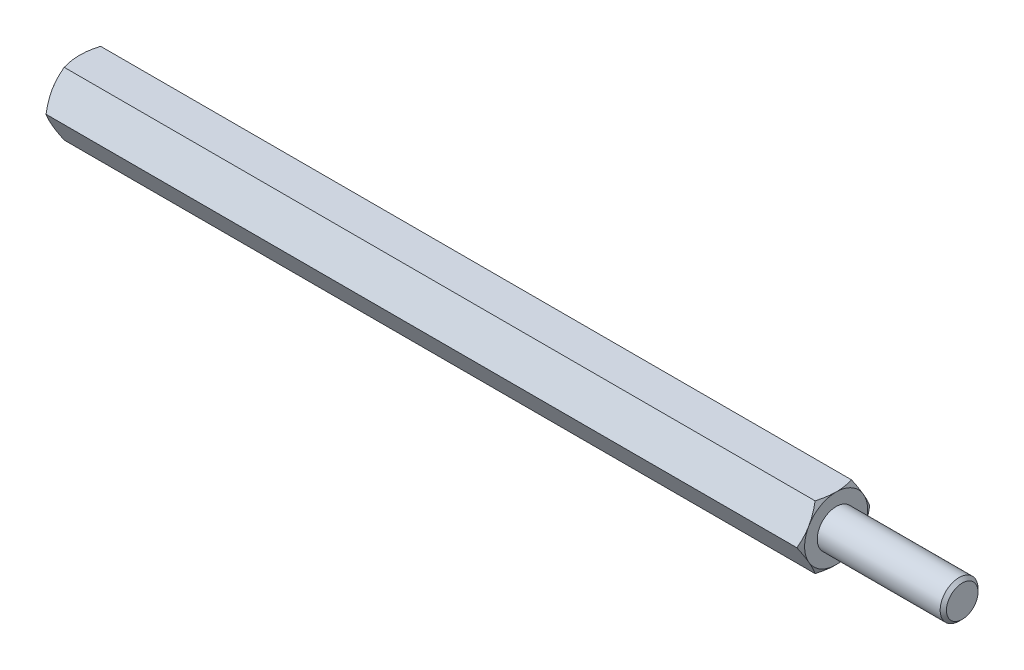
ISO-10303-21;
HEADER;
FILE_DESCRIPTION(('STEP AP214'),'2;1');
FILE_NAME('part.step','',(''),(''),'','','');
FILE_SCHEMA(('AUTOMOTIVE_DESIGN { 1 0 10303 214 1 1 1 1 }'));
ENDSEC;
DATA;
#1=APPLICATION_CONTEXT('core data for automotive mechanical design processes');
#2=APPLICATION_PROTOCOL_DEFINITION('international standard','automotive_design',2000,#1);
#3=PRODUCT_CONTEXT('',#1,'mechanical');
#4=PRODUCT('Part','Part','',(#3));
#5=PRODUCT_RELATED_PRODUCT_CATEGORY('part','',(#4));
#6=PRODUCT_DEFINITION_FORMATION('','',#4);
#7=PRODUCT_DEFINITION_CONTEXT('part definition',#1,'design');
#8=PRODUCT_DEFINITION('design','',#6,#7);
#9=PRODUCT_DEFINITION_SHAPE('','',#8);
#10=(LENGTH_UNIT() NAMED_UNIT(*) SI_UNIT(.MILLI.,.METRE.));
#11=(NAMED_UNIT(*) PLANE_ANGLE_UNIT() SI_UNIT($,.RADIAN.));
#12=(NAMED_UNIT(*) SI_UNIT($,.STERADIAN.) SOLID_ANGLE_UNIT());
#13=UNCERTAINTY_MEASURE_WITH_UNIT(LENGTH_MEASURE(1.E-05),#10,'distance_accuracy_value','');
#14=(GEOMETRIC_REPRESENTATION_CONTEXT(3) GLOBAL_UNCERTAINTY_ASSIGNED_CONTEXT((#13)) GLOBAL_UNIT_ASSIGNED_CONTEXT((#10,
#11,#12)) REPRESENTATION_CONTEXT('',''));
#15=CARTESIAN_POINT('',(0.,0.,0.));
#16=DIRECTION('',(0.,0.,1.));
#17=DIRECTION('',(1.,0.,0.));
#18=AXIS2_PLACEMENT_3D('',#15,#16,#17);
#19=CARTESIAN_POINT('',(30.,2.5,-1.44337567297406));
#20=DIRECTION('',(1.,0.,0.));
#21=DIRECTION('',(0.,0.,-1.));
#22=AXIS2_PLACEMENT_3D('',#19,#20,#21);
#23=PLANE('',#22);
#24=CARTESIAN_POINT('',(30.,0.,0.));
#25=DIRECTION('',(1.,0.,0.));
#26=DIRECTION('',(0.,0.,-1.));
#27=AXIS2_PLACEMENT_3D('',#24,#25,#26);
#28=CIRCLE('',#27,2.50000000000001);
#29=CARTESIAN_POINT('',(30.,-1.25,-2.16506350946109));
#30=VERTEX_POINT('',#29);
#31=CARTESIAN_POINT('',(30.,1.25,-2.1650635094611));
#32=VERTEX_POINT('',#31);
#33=EDGE_CURVE('E288',#30,#32,#28,.T.);
#34=ORIENTED_EDGE('',*,*,#33,.T.);
#35=CARTESIAN_POINT('',(30.,2.5,0.));
#36=VERTEX_POINT('',#35);
#37=EDGE_CURVE('E53',#32,#36,#28,.T.);
#38=ORIENTED_EDGE('',*,*,#37,.T.);
#39=CARTESIAN_POINT('',(30.,1.25,2.1650635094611));
#40=VERTEX_POINT('',#39);
#41=EDGE_CURVE('E296',#36,#40,#28,.T.);
#42=ORIENTED_EDGE('',*,*,#41,.T.);
#43=CARTESIAN_POINT('',(30.,-1.25000000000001,2.1650635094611));
#44=VERTEX_POINT('',#43);
#45=EDGE_CURVE('E300',#40,#44,#28,.T.);
#46=ORIENTED_EDGE('',*,*,#45,.T.);
#47=CARTESIAN_POINT('',(30.,0.,0.));
#48=DIRECTION('',(-1.,0.,0.));
#49=DIRECTION('',(0.,-1.,0.));
#50=AXIS2_PLACEMENT_3D('',#47,#48,#49);
#51=CIRCLE('',#50,2.50000000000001);
#52=CARTESIAN_POINT('',(30.,-2.50000000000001,0.));
#53=VERTEX_POINT('',#52);
#54=EDGE_CURVE('E193',#53,#44,#51,.T.);
#55=ORIENTED_EDGE('',*,*,#54,.F.);
#56=EDGE_CURVE('E61',#53,#30,#28,.T.);
#57=ORIENTED_EDGE('',*,*,#56,.T.);
#58=EDGE_LOOP('',(#34,#38,#42,#46,#55,#57));
#59=FACE_BOUND('',#58,.T.);
#60=CARTESIAN_POINT('',(30.,0.,0.));
#61=DIRECTION('',(1.,0.,0.));
#62=DIRECTION('',(0.,0.,-1.));
#63=AXIS2_PLACEMENT_3D('',#60,#61,#62);
#64=CIRCLE('',#63,1.5);
#65=CARTESIAN_POINT('',(30.,0.,-1.5));
#66=VERTEX_POINT('',#65);
#67=EDGE_CURVE('E311',#66,#66,#64,.T.);
#68=ORIENTED_EDGE('',*,*,#67,.F.);
#69=EDGE_LOOP('',(#68));
#70=FACE_BOUND('',#69,.T.);
#71=ADVANCED_FACE('F37',(#59,#70),#23,.T.);
#72=CARTESIAN_POINT('',(30.,0.,-2.88675134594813));
#73=DIRECTION('',(0.,-0.5,0.866025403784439));
#74=DIRECTION('',(0.,-0.866025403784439,-0.5));
#75=AXIS2_PLACEMENT_3D('',#72,#73,#74);
#76=PLANE('',#75);
#77=CARTESIAN_POINT('',(29.7766423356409,-0.000200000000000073,-2.88686681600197));
#78=CARTESIAN_POINT('',(29.8132783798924,0.109663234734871,-2.82343724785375));
#79=CARTESIAN_POINT('',(29.8465977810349,0.220474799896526,-2.75946016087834));
#80=CARTESIAN_POINT('',(29.9047577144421,0.44401683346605,-2.63039810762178));
#81=CARTESIAN_POINT('',(29.9295776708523,0.556751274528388,-2.5653108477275));
#82=CARTESIAN_POINT('',(29.9682143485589,0.780822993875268,-2.43594298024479));
#83=CARTESIAN_POINT('',(29.9822882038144,0.892125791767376,-2.37168227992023));
#84=CARTESIAN_POINT('',(29.9990908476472,1.11525522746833,-2.24285844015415));
#85=CARTESIAN_POINT('',(30.0018335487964,1.22708105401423,-2.17829576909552));
#86=CARTESIAN_POINT('',(29.9961342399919,1.43604197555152,-2.05765212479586));
#87=CARTESIAN_POINT('',(29.9890916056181,1.53320831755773,-2.0015531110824));
#88=CARTESIAN_POINT('',(29.9667685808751,1.726907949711,-1.88972057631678));
#89=CARTESIAN_POINT('',(29.9514805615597,1.82344056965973,-1.8339874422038));
#90=CARTESIAN_POINT('',(29.9132609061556,2.01753972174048,-1.7219242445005));
#91=CARTESIAN_POINT('',(29.8901672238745,2.11508168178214,-1.66560836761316));
#92=CARTESIAN_POINT('',(29.8377533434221,2.30871060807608,-1.55381665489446));
#93=CARTESIAN_POINT('',(29.8084454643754,2.40480005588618,-1.49833938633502));
#94=CARTESIAN_POINT('',(29.7766423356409,2.5002,-1.44326020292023));
#95=B_SPLINE_CURVE_WITH_KNOTS('',3,(#77,#78,#79,#80,#81,#82,#83,#84,#85,#86,#87,#88,#89,#90,#91,
#92,#93,#94),.UNSPECIFIED.,.F.,.F.,(4,2,2,2,2,2,2,2,4),(0.,0.396285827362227,0.79352433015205,
1.18093086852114,1.56786160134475,1.90479741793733,2.24204551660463,2.58677531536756,
2.93082800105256),.UNSPECIFIED.);
#96=CARTESIAN_POINT('',(29.7767090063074,0.,-2.88675134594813));
#97=VERTEX_POINT('',#96);
#98=EDGE_CURVE('E316',#97,#32,#95,.T.);
#99=ORIENTED_EDGE('',*,*,#98,.F.);
#100=DIRECTION('',(-1.,0.,0.));
#101=VECTOR('',#100,1.);
#102=CARTESIAN_POINT('',(30.,0.,-2.88675134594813));
#103=LINE('',#102,#101);
#104=CARTESIAN_POINT('',(-29.7767090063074,0.,-2.88675134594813));
#105=VERTEX_POINT('',#104);
#106=EDGE_CURVE('E264',#97,#105,#103,.T.);
#107=ORIENTED_EDGE('',*,*,#106,.T.);
#108=CARTESIAN_POINT('',(-29.7766423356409,2.5002,-1.44326020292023));
#109=CARTESIAN_POINT('',(-29.8132783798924,2.39033676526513,-1.50668977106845));
#110=CARTESIAN_POINT('',(-29.8465977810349,2.27952520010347,-1.57066685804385));
#111=CARTESIAN_POINT('',(-29.9047577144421,2.05598316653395,-1.69972891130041));
#112=CARTESIAN_POINT('',(-29.9295776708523,1.94324872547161,-1.7648161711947));
#113=CARTESIAN_POINT('',(-29.9682143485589,1.71917700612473,-1.8941840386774));
#114=CARTESIAN_POINT('',(-29.9822882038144,1.60787420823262,-1.95844473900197));
#115=CARTESIAN_POINT('',(-29.9990908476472,1.38474477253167,-2.08726857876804));
#116=CARTESIAN_POINT('',(-30.0018335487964,1.27291894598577,-2.15183124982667));
#117=CARTESIAN_POINT('',(-29.9961342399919,1.06395802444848,-2.27247489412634));
#118=CARTESIAN_POINT('',(-29.9890916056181,0.966791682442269,-2.32857390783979));
#119=CARTESIAN_POINT('',(-29.9667685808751,0.773092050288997,-2.44040644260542));
#120=CARTESIAN_POINT('',(-29.9514805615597,0.676559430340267,-2.4961395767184));
#121=CARTESIAN_POINT('',(-29.9132609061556,0.482460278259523,-2.60820277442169));
#122=CARTESIAN_POINT('',(-29.8901672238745,0.384918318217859,-2.66451865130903));
#123=CARTESIAN_POINT('',(-29.8377533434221,0.191289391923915,-2.77631036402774));
#124=CARTESIAN_POINT('',(-29.8084454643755,0.0951999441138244,-2.83178763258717));
#125=CARTESIAN_POINT('',(-29.7766423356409,-0.000200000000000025,-2.88686681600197));
#126=B_SPLINE_CURVE_WITH_KNOTS('',3,(#108,#109,#110,#111,#112,#113,#114,#115,#116,#117,#118,
#119,#120,#121,#122,#123,#124,#125),.UNSPECIFIED.,.F.,.F.,(4,2,2,2,2,2,2,2,4),(0.,
0.396285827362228,0.793524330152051,1.18093086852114,1.56786160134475,1.90479741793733,
2.24204551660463,2.58677531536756,2.93082800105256),.UNSPECIFIED.);
#127=CARTESIAN_POINT('',(-30.,1.25,-2.1650635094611));
#128=VERTEX_POINT('',#127);
#129=EDGE_CURVE('E362',#128,#105,#126,.T.);
#130=ORIENTED_EDGE('',*,*,#129,.F.);
#131=CARTESIAN_POINT('',(-29.7767090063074,2.5,-1.44337567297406));
#132=VERTEX_POINT('',#131);
#133=EDGE_CURVE('E357',#132,#128,#126,.T.);
#134=ORIENTED_EDGE('',*,*,#133,.F.);
#135=DIRECTION('',(-1.,0.,0.));
#136=VECTOR('',#135,1.);
#137=CARTESIAN_POINT('',(30.,2.5,-1.44337567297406));
#138=LINE('',#137,#136);
#139=CARTESIAN_POINT('',(29.7767090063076,2.5,-1.44337567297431));
#140=VERTEX_POINT('',#139);
#141=EDGE_CURVE('E279',#140,#132,#138,.T.);
#142=ORIENTED_EDGE('',*,*,#141,.F.);
#143=EDGE_CURVE('E229',#32,#140,#95,.T.);
#144=ORIENTED_EDGE('',*,*,#143,.F.);
#145=EDGE_LOOP('',(#99,#107,#130,#134,#142,#144));
#146=FACE_BOUND('',#145,.T.);
#147=ADVANCED_FACE('F148',(#146),#76,.F.);
#148=CARTESIAN_POINT('',(30.,2.5,-1.44337567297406));
#149=DIRECTION('',(0.,-1.,0.));
#150=DIRECTION('',(0.,0.,-1.));
#151=AXIS2_PLACEMENT_3D('',#148,#149,#150);
#152=PLANE('',#151);
#153=CARTESIAN_POINT('',(28.7680338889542,2.5,-3.90158441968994));
#154=CARTESIAN_POINT('',(28.8212077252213,2.5,-3.79217004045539));
#155=CARTESIAN_POINT('',(28.8738786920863,2.5,-3.68250707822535));
#156=CARTESIAN_POINT('',(28.9779324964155,2.5,-3.46255185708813));
#157=CARTESIAN_POINT('',(29.0293151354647,2.5,-3.35225950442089));
#158=CARTESIAN_POINT('',(29.1307630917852,2.5,-3.13035696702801));
#159=CARTESIAN_POINT('',(29.1808199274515,2.5,-3.0187428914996));
#160=CARTESIAN_POINT('',(29.2789171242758,2.5,-2.79463535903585));
#161=CARTESIAN_POINT('',(29.3269575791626,2.5,-2.68214194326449));
#162=CARTESIAN_POINT('',(29.4220184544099,2.5,-2.45240385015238));
#163=CARTESIAN_POINT('',(29.4689543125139,2.5,-2.33512399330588));
#164=CARTESIAN_POINT('',(29.5593326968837,2.5,-2.09920133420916));
#165=CARTESIAN_POINT('',(29.6027748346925,2.5,-1.98055838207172));
#166=CARTESIAN_POINT('',(29.6850435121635,2.5,-1.74193489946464));
#167=CARTESIAN_POINT('',(29.7238791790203,2.5,-1.6219575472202));
#168=CARTESIAN_POINT('',(29.7957050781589,2.5,-1.38028205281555));
#169=CARTESIAN_POINT('',(29.8286971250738,2.5,-1.25858445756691));
#170=CARTESIAN_POINT('',(29.8870959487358,2.5,-1.01406369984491));
#171=CARTESIAN_POINT('',(29.9125437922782,2.5,-0.891250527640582));
#172=CARTESIAN_POINT('',(29.9544275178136,2.5,-0.644071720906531));
#173=CARTESIAN_POINT('',(29.9708643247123,2.5,-0.519706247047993));
#174=CARTESIAN_POINT('',(29.9932006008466,2.5,-0.271679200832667));
#175=CARTESIAN_POINT('',(29.9992375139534,2.5,-0.148030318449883));
#176=CARTESIAN_POINT('',(30.0006256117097,2.5,0.0993395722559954));
#177=CARTESIAN_POINT('',(29.9959765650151,2.5,0.223060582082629));
#178=CARTESIAN_POINT('',(29.9794044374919,2.5,0.432351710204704));
#179=CARTESIAN_POINT('',(29.9701066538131,2.5,0.518143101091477));
#180=CARTESIAN_POINT('',(29.9469384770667,2.5,0.68911205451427));
#181=CARTESIAN_POINT('',(29.9330674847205,2.5,0.774289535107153));
#182=CARTESIAN_POINT('',(29.8853202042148,2.5,1.02876599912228));
#183=CARTESIAN_POINT('',(29.8453176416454,2.5,1.19691958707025));
#184=CARTESIAN_POINT('',(29.7522656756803,2.5,1.53362893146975));
#185=CARTESIAN_POINT('',(29.6989362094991,2.5,1.70210423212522));
#186=CARTESIAN_POINT('',(29.6123716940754,2.5,1.95247339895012));
#187=CARTESIAN_POINT('',(29.5824247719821,2.5,2.0355318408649));
#188=CARTESIAN_POINT('',(29.5206840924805,2.5,2.20095860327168));
#189=CARTESIAN_POINT('',(29.4888903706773,2.5,2.28332693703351));
#190=CARTESIAN_POINT('',(29.404014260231,2.5,2.49723312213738));
#191=CARTESIAN_POINT('',(29.3497173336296,2.5,2.62828796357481));
#192=CARTESIAN_POINT('',(29.2381273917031,2.5,2.88912034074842));
#193=CARTESIAN_POINT('',(29.1808341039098,2.5,3.01889775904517));
#194=CARTESIAN_POINT('',(29.0639348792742,2.5,3.27745045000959));
#195=CARTESIAN_POINT('',(29.004328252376,2.5,3.40622540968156));
#196=CARTESIAN_POINT('',(28.8833234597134,2.5,3.66293235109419));
#197=CARTESIAN_POINT('',(28.821925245,2.5,3.7908643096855));
#198=CARTESIAN_POINT('',(28.6354580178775,2.5,4.17399495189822));
#199=CARTESIAN_POINT('',(28.5082824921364,2.5,4.42816724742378));
#200=CARTESIAN_POINT('',(28.2503455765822,2.5,4.93461464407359));
#201=CARTESIAN_POINT('',(28.1195848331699,2.5,5.1868900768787));
#202=CARTESIAN_POINT('',(27.8687100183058,2.5,5.66512451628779));
#203=CARTESIAN_POINT('',(27.7488298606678,2.5,5.89120644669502));
#204=CARTESIAN_POINT('',(27.5075902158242,2.5,6.34259369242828));
#205=CARTESIAN_POINT('',(27.3862306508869,2.5,6.56789896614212));
#206=CARTESIAN_POINT('',(27.142780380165,2.5,7.01722044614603));
#207=CARTESIAN_POINT('',(27.0206930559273,2.5,7.24123848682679));
#208=CARTESIAN_POINT('',(26.7756662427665,2.5,7.68878772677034));
#209=CARTESIAN_POINT('',(26.652726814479,2.5,7.91231895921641));
#210=CARTESIAN_POINT('',(26.5294756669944,2.5,8.1356769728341));
#211=B_SPLINE_CURVE_WITH_KNOTS('',3,(#153,#154,#155,#156,#157,#158,#159,#160,#161,#162,#163,
#164,#165,#166,#167,#168,#169,#170,#171,#172,#173,#174,#175,#176,#177,#178,#179,#180,#181,#182,
#183,#184,#185,#186,#187,#188,#189,#190,#191,#192,#193,#194,#195,#196,#197,#198,#199,#200,#201,
#202,#203,#204,#205,#206,#207,#208,#209,#210),.UNSPECIFIED.,.F.,.F.,(4,2,2,2,2,2,2,2,2,2,2,2,2,
2,2,2,2,2,2,2,2,2,2,2,2,2,2,2,4),(0.,0.364957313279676,0.729970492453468,1.09692930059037,
1.46387103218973,1.84279746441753,2.22176597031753,2.59997058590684,2.97805755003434,
3.3540469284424,3.72999770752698,4.10094071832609,4.47189175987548,4.73064905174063,
4.98944026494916,5.50729076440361,6.037104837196,6.30196454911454,6.56681915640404,
6.99233818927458,7.41789598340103,7.84358170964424,8.26927907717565,9.12186602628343,
9.97430025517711,10.7419897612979,11.509719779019,12.2750964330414,13.0404191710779),.UNSPECIFIED.);
#212=EDGE_CURVE('E227',#140,#36,#211,.T.);
#213=ORIENTED_EDGE('',*,*,#212,.F.);
#214=ORIENTED_EDGE('',*,*,#141,.T.);
#215=CARTESIAN_POINT('',(-28.7680338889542,2.5,-3.90158441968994));
#216=CARTESIAN_POINT('',(-28.8212077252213,2.5,-3.79217004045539));
#217=CARTESIAN_POINT('',(-28.8738786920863,2.5,-3.68250707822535));
#218=CARTESIAN_POINT('',(-28.9779324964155,2.5,-3.46255185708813));
#219=CARTESIAN_POINT('',(-29.0293151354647,2.5,-3.35225950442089));
#220=CARTESIAN_POINT('',(-29.1307630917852,2.5,-3.13035696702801));
#221=CARTESIAN_POINT('',(-29.1808199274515,2.5,-3.0187428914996));
#222=CARTESIAN_POINT('',(-29.2789171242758,2.5,-2.79463535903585));
#223=CARTESIAN_POINT('',(-29.3269575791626,2.5,-2.68214194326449));
#224=CARTESIAN_POINT('',(-29.4220184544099,2.5,-2.45240385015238));
#225=CARTESIAN_POINT('',(-29.4689543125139,2.5,-2.33512399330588));
#226=CARTESIAN_POINT('',(-29.5593326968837,2.5,-2.09920133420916));
#227=CARTESIAN_POINT('',(-29.6027748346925,2.5,-1.98055838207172));
#228=CARTESIAN_POINT('',(-29.6850435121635,2.5,-1.74193489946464));
#229=CARTESIAN_POINT('',(-29.7238791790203,2.5,-1.6219575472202));
#230=CARTESIAN_POINT('',(-29.7957050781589,2.5,-1.38028205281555));
#231=CARTESIAN_POINT('',(-29.8286971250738,2.5,-1.25858445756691));
#232=CARTESIAN_POINT('',(-29.8870959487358,2.5,-1.01406369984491));
#233=CARTESIAN_POINT('',(-29.9125437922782,2.5,-0.891250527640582));
#234=CARTESIAN_POINT('',(-29.9544275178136,2.5,-0.644071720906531));
#235=CARTESIAN_POINT('',(-29.9708643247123,2.5,-0.519706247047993));
#236=CARTESIAN_POINT('',(-29.9932006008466,2.5,-0.271679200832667));
#237=CARTESIAN_POINT('',(-29.9992375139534,2.5,-0.148030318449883));
#238=CARTESIAN_POINT('',(-30.0006256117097,2.5,0.0993395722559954));
#239=CARTESIAN_POINT('',(-29.9959765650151,2.5,0.223060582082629));
#240=CARTESIAN_POINT('',(-29.9794044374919,2.5,0.432351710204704));
#241=CARTESIAN_POINT('',(-29.9701066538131,2.5,0.518143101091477));
#242=CARTESIAN_POINT('',(-29.9469384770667,2.5,0.68911205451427));
#243=CARTESIAN_POINT('',(-29.9330674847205,2.5,0.774289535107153));
#244=CARTESIAN_POINT('',(-29.8853202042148,2.5,1.02876599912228));
#245=CARTESIAN_POINT('',(-29.8453176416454,2.5,1.19691958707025));
#246=CARTESIAN_POINT('',(-29.7522656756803,2.5,1.53362893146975));
#247=CARTESIAN_POINT('',(-29.6989362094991,2.5,1.70210423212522));
#248=CARTESIAN_POINT('',(-29.6123716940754,2.5,1.95247339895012));
#249=CARTESIAN_POINT('',(-29.5824247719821,2.5,2.0355318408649));
#250=CARTESIAN_POINT('',(-29.5206840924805,2.5,2.20095860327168));
#251=CARTESIAN_POINT('',(-29.4888903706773,2.5,2.28332693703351));
#252=CARTESIAN_POINT('',(-29.404014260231,2.5,2.49723312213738));
#253=CARTESIAN_POINT('',(-29.3497173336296,2.5,2.62828796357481));
#254=CARTESIAN_POINT('',(-29.2381273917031,2.5,2.88912034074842));
#255=CARTESIAN_POINT('',(-29.1808341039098,2.5,3.01889775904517));
#256=CARTESIAN_POINT('',(-29.0639348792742,2.5,3.27745045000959));
#257=CARTESIAN_POINT('',(-29.004328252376,2.5,3.40622540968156));
#258=CARTESIAN_POINT('',(-28.8833234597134,2.5,3.66293235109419));
#259=CARTESIAN_POINT('',(-28.821925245,2.5,3.7908643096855));
#260=CARTESIAN_POINT('',(-28.6354580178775,2.5,4.17399495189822));
#261=CARTESIAN_POINT('',(-28.5082824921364,2.5,4.42816724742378));
#262=CARTESIAN_POINT('',(-28.2503455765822,2.5,4.93461464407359));
#263=CARTESIAN_POINT('',(-28.1195848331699,2.5,5.1868900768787));
#264=CARTESIAN_POINT('',(-27.8687100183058,2.5,5.66512451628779));
#265=CARTESIAN_POINT('',(-27.7488298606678,2.5,5.89120644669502));
#266=CARTESIAN_POINT('',(-27.5075902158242,2.5,6.34259369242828));
#267=CARTESIAN_POINT('',(-27.3862306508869,2.5,6.56789896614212));
#268=CARTESIAN_POINT('',(-27.142780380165,2.5,7.01722044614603));
#269=CARTESIAN_POINT('',(-27.0206930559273,2.5,7.24123848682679));
#270=CARTESIAN_POINT('',(-26.7756662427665,2.5,7.68878772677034));
#271=CARTESIAN_POINT('',(-26.652726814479,2.5,7.91231895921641));
#272=CARTESIAN_POINT('',(-26.5294756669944,2.5,8.1356769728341));
#273=B_SPLINE_CURVE_WITH_KNOTS('',3,(#215,#216,#217,#218,#219,#220,#221,#222,#223,#224,#225,
#226,#227,#228,#229,#230,#231,#232,#233,#234,#235,#236,#237,#238,#239,#240,#241,#242,#243,#244,
#245,#246,#247,#248,#249,#250,#251,#252,#253,#254,#255,#256,#257,#258,#259,#260,#261,#262,#263,
#264,#265,#266,#267,#268,#269,#270,#271,#272),.UNSPECIFIED.,.F.,.F.,(4,2,2,2,2,2,2,2,2,2,2,2,2,
2,2,2,2,2,2,2,2,2,2,2,2,2,2,2,4),(0.,0.364957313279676,0.729970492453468,1.09692930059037,
1.46387103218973,1.84279746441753,2.22176597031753,2.59997058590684,2.97805755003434,
3.3540469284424,3.72999770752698,4.10094071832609,4.47189175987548,4.73064905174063,
4.98944026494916,5.50729076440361,6.037104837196,6.30196454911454,6.56681915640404,
6.99233818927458,7.41789598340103,7.84358170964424,8.26927907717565,9.12186602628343,
9.97430025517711,10.7419897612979,11.509719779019,12.2750964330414,13.0404191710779),.UNSPECIFIED.);
#274=CARTESIAN_POINT('',(-30.,2.5,0.));
#275=VERTEX_POINT('',#274);
#276=EDGE_CURVE('E241',#275,#132,#273,.F.);
#277=ORIENTED_EDGE('',*,*,#276,.F.);
#278=CARTESIAN_POINT('',(-29.7767090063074,2.5,1.44337567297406));
#279=VERTEX_POINT('',#278);
#280=EDGE_CURVE('E249',#279,#275,#273,.F.);
#281=ORIENTED_EDGE('',*,*,#280,.F.);
#282=DIRECTION('',(-1.,0.,0.));
#283=VECTOR('',#282,1.);
#284=CARTESIAN_POINT('',(30.,2.5,1.44337567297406));
#285=LINE('',#284,#283);
#286=CARTESIAN_POINT('',(29.7767090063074,2.5,1.44337567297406));
#287=VERTEX_POINT('',#286);
#288=EDGE_CURVE('E276',#287,#279,#285,.T.);
#289=ORIENTED_EDGE('',*,*,#288,.F.);
#290=EDGE_CURVE('E221',#36,#287,#211,.T.);
#291=ORIENTED_EDGE('',*,*,#290,.F.);
#292=EDGE_LOOP('',(#213,#214,#277,#281,#289,#291));
#293=FACE_BOUND('',#292,.T.);
#294=ADVANCED_FACE('F153',(#293),#152,.F.);
#295=CARTESIAN_POINT('',(30.,2.5,1.44337567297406));
#296=DIRECTION('',(0.,-0.5,-0.866025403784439));
#297=DIRECTION('',(0.,0.866025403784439,-0.5));
#298=AXIS2_PLACEMENT_3D('',#295,#296,#297);
#299=PLANE('',#298);
#300=CARTESIAN_POINT('',(29.7766423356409,2.5002,1.44326020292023));
#301=CARTESIAN_POINT('',(29.8132783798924,2.39033676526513,1.50668977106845));
#302=CARTESIAN_POINT('',(29.8465977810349,2.27952520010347,1.57066685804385));
#303=CARTESIAN_POINT('',(29.9047577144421,2.05598316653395,1.69972891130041));
#304=CARTESIAN_POINT('',(29.9295776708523,1.94324872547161,1.7648161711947));
#305=CARTESIAN_POINT('',(29.9682143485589,1.71917700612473,1.8941840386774));
#306=CARTESIAN_POINT('',(29.9822882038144,1.60787420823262,1.95844473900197));
#307=CARTESIAN_POINT('',(29.9990908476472,1.38474477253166,2.08726857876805));
#308=CARTESIAN_POINT('',(30.0018335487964,1.27291894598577,2.15183124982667));
#309=CARTESIAN_POINT('',(29.9961342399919,1.06395802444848,2.27247489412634));
#310=CARTESIAN_POINT('',(29.9890916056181,0.966791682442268,2.32857390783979));
#311=CARTESIAN_POINT('',(29.9667685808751,0.773092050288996,2.44040644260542));
#312=CARTESIAN_POINT('',(29.9514805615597,0.676559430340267,2.4961395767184));
#313=CARTESIAN_POINT('',(29.9132609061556,0.482460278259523,2.60820277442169));
#314=CARTESIAN_POINT('',(29.8901672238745,0.384918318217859,2.66451865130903));
#315=CARTESIAN_POINT('',(29.8377533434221,0.191289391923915,2.77631036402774));
#316=CARTESIAN_POINT('',(29.8084454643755,0.095199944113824,2.83178763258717));
#317=CARTESIAN_POINT('',(29.7766423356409,-0.000199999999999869,2.88686681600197));
#318=B_SPLINE_CURVE_WITH_KNOTS('',3,(#300,#301,#302,#303,#304,#305,#306,#307,#308,#309,#310,
#311,#312,#313,#314,#315,#316,#317),.UNSPECIFIED.,.F.,.F.,(4,2,2,2,2,2,2,2,4),(0.,
0.396285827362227,0.793524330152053,1.18093086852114,1.56786160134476,1.90479741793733,
2.24204551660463,2.58677531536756,2.93082800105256),.UNSPECIFIED.);
#319=EDGE_CURVE('E228',#287,#40,#318,.T.);
#320=ORIENTED_EDGE('',*,*,#319,.F.);
#321=ORIENTED_EDGE('',*,*,#288,.T.);
#322=CARTESIAN_POINT('',(-29.7766423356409,-0.000199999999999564,2.88686681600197));
#323=CARTESIAN_POINT('',(-29.8132783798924,0.109663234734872,2.82343724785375));
#324=CARTESIAN_POINT('',(-29.8465977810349,0.220474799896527,2.75946016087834));
#325=CARTESIAN_POINT('',(-29.9047577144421,0.444016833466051,2.63039810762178));
#326=CARTESIAN_POINT('',(-29.9295776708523,0.556751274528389,2.5653108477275));
#327=CARTESIAN_POINT('',(-29.9682143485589,0.780822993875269,2.43594298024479));
#328=CARTESIAN_POINT('',(-29.9822882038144,0.892125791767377,2.37168227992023));
#329=CARTESIAN_POINT('',(-29.9990908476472,1.11525522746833,2.24285844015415));
#330=CARTESIAN_POINT('',(-30.0018335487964,1.22708105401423,2.17829576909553));
#331=CARTESIAN_POINT('',(-29.9961342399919,1.43604197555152,2.05765212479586));
#332=CARTESIAN_POINT('',(-29.9890916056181,1.53320831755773,2.0015531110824));
#333=CARTESIAN_POINT('',(-29.9667685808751,1.726907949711,1.88972057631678));
#334=CARTESIAN_POINT('',(-29.9514805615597,1.82344056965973,1.8339874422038));
#335=CARTESIAN_POINT('',(-29.9132609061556,2.01753972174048,1.7219242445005));
#336=CARTESIAN_POINT('',(-29.8901672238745,2.11508168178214,1.66560836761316));
#337=CARTESIAN_POINT('',(-29.8377533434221,2.30871060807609,1.55381665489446));
#338=CARTESIAN_POINT('',(-29.8084454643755,2.40480005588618,1.49833938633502));
#339=CARTESIAN_POINT('',(-29.7766423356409,2.5002,1.44326020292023));
#340=B_SPLINE_CURVE_WITH_KNOTS('',3,(#322,#323,#324,#325,#326,#327,#328,#329,#330,#331,#332,
#333,#334,#335,#336,#337,#338,#339),.UNSPECIFIED.,.F.,.F.,(4,2,2,2,2,2,2,2,4),(0.,
0.396285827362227,0.793524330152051,1.18093086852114,1.56786160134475,1.90479741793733,
2.24204551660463,2.58677531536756,2.93082800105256),.UNSPECIFIED.);
#341=CARTESIAN_POINT('',(-30.,1.25,2.1650635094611));
#342=VERTEX_POINT('',#341);
#343=EDGE_CURVE('E255',#342,#279,#340,.T.);
#344=ORIENTED_EDGE('',*,*,#343,.F.);
#345=CARTESIAN_POINT('',(-29.7767090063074,0.,2.88675134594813));
#346=VERTEX_POINT('',#345);
#347=EDGE_CURVE('E262',#346,#342,#340,.T.);
#348=ORIENTED_EDGE('',*,*,#347,.F.);
#349=DIRECTION('',(-1.,0.,0.));
#350=VECTOR('',#349,1.);
#351=CARTESIAN_POINT('',(30.,0.,2.88675134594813));
#352=LINE('',#351,#350);
#353=CARTESIAN_POINT('',(29.7767090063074,0.,2.88675134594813));
#354=VERTEX_POINT('',#353);
#355=EDGE_CURVE('E273',#354,#346,#352,.T.);
#356=ORIENTED_EDGE('',*,*,#355,.F.);
#357=EDGE_CURVE('E215',#40,#354,#318,.T.);
#358=ORIENTED_EDGE('',*,*,#357,.F.);
#359=EDGE_LOOP('',(#320,#321,#344,#348,#356,#358));
#360=FACE_BOUND('',#359,.T.);
#361=ADVANCED_FACE('F235',(#360),#299,.F.);
#362=CARTESIAN_POINT('',(30.,0.,2.88675134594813));
#363=DIRECTION('',(0.,0.5,-0.866025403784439));
#364=DIRECTION('',(0.,0.866025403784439,0.5));
#365=AXIS2_PLACEMENT_3D('',#362,#363,#364);
#366=PLANE('',#365);
#367=CARTESIAN_POINT('',(29.7766423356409,0.00020000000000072,2.88686681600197));
#368=CARTESIAN_POINT('',(29.8132783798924,-0.10966323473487,2.82343724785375));
#369=CARTESIAN_POINT('',(29.8465977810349,-0.220474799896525,2.75946016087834));
#370=CARTESIAN_POINT('',(29.9047577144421,-0.444016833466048,2.63039810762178));
#371=CARTESIAN_POINT('',(29.9295776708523,-0.556751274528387,2.5653108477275));
#372=CARTESIAN_POINT('',(29.968214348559,-0.780822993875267,2.43594298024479));
#373=CARTESIAN_POINT('',(29.9822882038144,-0.892125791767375,2.37168227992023));
#374=CARTESIAN_POINT('',(29.9990908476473,-1.11525522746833,2.24285844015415));
#375=CARTESIAN_POINT('',(30.0018335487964,-1.22708105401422,2.17829576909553));
#376=CARTESIAN_POINT('',(29.9961342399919,-1.43604197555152,2.05765212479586));
#377=CARTESIAN_POINT('',(29.9890916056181,-1.53320831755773,2.0015531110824));
#378=CARTESIAN_POINT('',(29.9667685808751,-1.726907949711,1.88972057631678));
#379=CARTESIAN_POINT('',(29.9514805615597,-1.82344056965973,1.8339874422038));
#380=CARTESIAN_POINT('',(29.9132609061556,-2.01753972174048,1.7219242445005));
#381=CARTESIAN_POINT('',(29.8901672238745,-2.11508168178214,1.66560836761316));
#382=CARTESIAN_POINT('',(29.8377533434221,-2.30871060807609,1.55381665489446));
#383=CARTESIAN_POINT('',(29.8084454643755,-2.40480005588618,1.49833938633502));
#384=CARTESIAN_POINT('',(29.7766423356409,-2.5002,1.44326020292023));
#385=B_SPLINE_CURVE_WITH_KNOTS('',3,(#367,#368,#369,#370,#371,#372,#373,#374,#375,#376,#377,
#378,#379,#380,#381,#382,#383,#384),.UNSPECIFIED.,.F.,.F.,(4,2,2,2,2,2,2,2,4),(0.,
0.396285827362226,0.79352433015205,1.18093086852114,1.56786160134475,1.90479741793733,
2.24204551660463,2.58677531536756,2.93082800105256),.UNSPECIFIED.);
#386=EDGE_CURVE('E398',#354,#44,#385,.T.);
#387=ORIENTED_EDGE('',*,*,#386,.F.);
#388=ORIENTED_EDGE('',*,*,#355,.T.);
#389=CARTESIAN_POINT('',(-29.7766423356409,-2.5002,1.44326020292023));
#390=CARTESIAN_POINT('',(-29.8132783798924,-2.39033676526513,1.50668977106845));
#391=CARTESIAN_POINT('',(-29.846597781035,-2.27952520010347,1.57066685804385));
#392=CARTESIAN_POINT('',(-29.9047577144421,-2.05598316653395,1.69972891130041));
#393=CARTESIAN_POINT('',(-29.9295776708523,-1.94324872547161,1.7648161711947));
#394=CARTESIAN_POINT('',(-29.968214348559,-1.71917700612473,1.8941840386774));
#395=CARTESIAN_POINT('',(-29.9822882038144,-1.60787420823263,1.95844473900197));
#396=CARTESIAN_POINT('',(-29.9990908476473,-1.38474477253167,2.08726857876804));
#397=CARTESIAN_POINT('',(-30.0018335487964,-1.27291894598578,2.15183124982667));
#398=CARTESIAN_POINT('',(-29.9961342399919,-1.06395802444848,2.27247489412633));
#399=CARTESIAN_POINT('',(-29.9890916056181,-0.966791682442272,2.32857390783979));
#400=CARTESIAN_POINT('',(-29.9667685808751,-0.773092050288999,2.44040644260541));
#401=CARTESIAN_POINT('',(-29.9514805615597,-0.676559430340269,2.49613957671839));
#402=CARTESIAN_POINT('',(-29.9132609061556,-0.482460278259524,2.60820277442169));
#403=CARTESIAN_POINT('',(-29.8901672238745,-0.384918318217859,2.66451865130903));
#404=CARTESIAN_POINT('',(-29.8377533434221,-0.191289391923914,2.77631036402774));
#405=CARTESIAN_POINT('',(-29.8084454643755,-0.0951999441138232,2.83178763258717));
#406=CARTESIAN_POINT('',(-29.7766423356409,0.000200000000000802,2.88686681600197));
#407=B_SPLINE_CURVE_WITH_KNOTS('',3,(#389,#390,#391,#392,#393,#394,#395,#396,#397,#398,#399,
#400,#401,#402,#403,#404,#405,#406),.UNSPECIFIED.,.F.,.F.,(4,2,2,2,2,2,2,2,4),(0.,
0.396285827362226,0.793524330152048,1.18093086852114,1.56786160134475,1.90479741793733,
2.24204551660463,2.58677531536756,2.93082800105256),.UNSPECIFIED.);
#408=CARTESIAN_POINT('',(-30.,-1.25000000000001,2.1650635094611));
#409=VERTEX_POINT('',#408);
#410=EDGE_CURVE('E263',#409,#346,#407,.T.);
#411=ORIENTED_EDGE('',*,*,#410,.F.);
#412=CARTESIAN_POINT('',(-29.7767090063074,-2.5,1.44337567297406));
#413=VERTEX_POINT('',#412);
#414=EDGE_CURVE('E250',#413,#409,#407,.T.);
#415=ORIENTED_EDGE('',*,*,#414,.F.);
#416=DIRECTION('',(-1.,0.,0.));
#417=VECTOR('',#416,1.);
#418=CARTESIAN_POINT('',(30.,-2.5,1.44337567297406));
#419=LINE('',#418,#417);
#420=CARTESIAN_POINT('',(29.7767090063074,-2.5,1.44337567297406));
#421=VERTEX_POINT('',#420);
#422=EDGE_CURVE('E270',#421,#413,#419,.T.);
#423=ORIENTED_EDGE('',*,*,#422,.F.);
#424=EDGE_CURVE('E210',#44,#421,#385,.T.);
#425=ORIENTED_EDGE('',*,*,#424,.F.);
#426=EDGE_LOOP('',(#387,#388,#411,#415,#423,#425));
#427=FACE_BOUND('',#426,.T.);
#428=ADVANCED_FACE('F397',(#427),#366,.F.);
#429=CARTESIAN_POINT('',(30.,-2.5,1.44337567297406));
#430=DIRECTION('',(0.,1.,0.));
#431=DIRECTION('',(0.,0.,1.));
#432=AXIS2_PLACEMENT_3D('',#429,#430,#431);
#433=PLANE('',#432);
#434=CARTESIAN_POINT('',(28.7680338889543,-2.5,-3.90158441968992));
#435=CARTESIAN_POINT('',(28.8212077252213,-2.5,-3.79217004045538));
#436=CARTESIAN_POINT('',(28.8738786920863,-2.5,-3.68250707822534));
#437=CARTESIAN_POINT('',(28.9779324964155,-2.5,-3.46255185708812));
#438=CARTESIAN_POINT('',(29.0293151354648,-2.5,-3.35225950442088));
#439=CARTESIAN_POINT('',(29.1307630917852,-2.5,-3.130356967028));
#440=CARTESIAN_POINT('',(29.1808199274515,-2.5,-3.01874289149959));
#441=CARTESIAN_POINT('',(29.2789171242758,-2.5,-2.79463535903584));
#442=CARTESIAN_POINT('',(29.3269575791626,-2.5,-2.68214194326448));
#443=CARTESIAN_POINT('',(29.4220184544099,-2.5,-2.45240385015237));
#444=CARTESIAN_POINT('',(29.4689543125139,-2.5,-2.33512399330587));
#445=CARTESIAN_POINT('',(29.5593326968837,-2.5,-2.09920133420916));
#446=CARTESIAN_POINT('',(29.6027748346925,-2.5,-1.98055838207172));
#447=CARTESIAN_POINT('',(29.6850435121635,-2.5,-1.74193489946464));
#448=CARTESIAN_POINT('',(29.7238791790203,-2.5,-1.6219575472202));
#449=CARTESIAN_POINT('',(29.7957050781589,-2.5,-1.38028205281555));
#450=CARTESIAN_POINT('',(29.8286971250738,-2.5,-1.25858445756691));
#451=CARTESIAN_POINT('',(29.8870959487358,-2.5,-1.01406369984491));
#452=CARTESIAN_POINT('',(29.9125437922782,-2.5,-0.891250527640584));
#453=CARTESIAN_POINT('',(29.9544275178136,-2.5,-0.644071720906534));
#454=CARTESIAN_POINT('',(29.9708643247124,-2.5,-0.519706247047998));
#455=CARTESIAN_POINT('',(29.9932006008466,-2.5,-0.271679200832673));
#456=CARTESIAN_POINT('',(29.9992375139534,-2.5,-0.148030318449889));
#457=CARTESIAN_POINT('',(30.0006256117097,-2.5,0.0993395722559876));
#458=CARTESIAN_POINT('',(29.9959765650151,-2.5,0.223060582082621));
#459=CARTESIAN_POINT('',(29.979404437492,-2.5,0.432351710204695));
#460=CARTESIAN_POINT('',(29.9701066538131,-2.5,0.518143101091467));
#461=CARTESIAN_POINT('',(29.9469384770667,-2.5,0.689112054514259));
#462=CARTESIAN_POINT('',(29.9330674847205,-2.5,0.774289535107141));
#463=CARTESIAN_POINT('',(29.8853202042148,-2.5,1.02876599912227));
#464=CARTESIAN_POINT('',(29.8453176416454,-2.5,1.19691958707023));
#465=CARTESIAN_POINT('',(29.7522656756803,-2.5,1.53362893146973));
#466=CARTESIAN_POINT('',(29.6989362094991,-2.5,1.7021042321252));
#467=CARTESIAN_POINT('',(29.6123716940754,-2.5,1.9524733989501));
#468=CARTESIAN_POINT('',(29.5824247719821,-2.5,2.03553184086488));
#469=CARTESIAN_POINT('',(29.5206840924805,-2.5,2.20095860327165));
#470=CARTESIAN_POINT('',(29.4888903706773,-2.5,2.28332693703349));
#471=CARTESIAN_POINT('',(29.404014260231,-2.5,2.49723312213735));
#472=CARTESIAN_POINT('',(29.3497173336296,-2.5,2.62828796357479));
#473=CARTESIAN_POINT('',(29.2381273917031,-2.5,2.88912034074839));
#474=CARTESIAN_POINT('',(29.1808341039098,-2.5,3.01889775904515));
#475=CARTESIAN_POINT('',(29.0639348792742,-2.5,3.27745045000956));
#476=CARTESIAN_POINT('',(29.004328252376,-2.5,3.40622540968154));
#477=CARTESIAN_POINT('',(28.8833234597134,-2.5,3.66293235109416));
#478=CARTESIAN_POINT('',(28.821925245,-2.5,3.79086430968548));
#479=CARTESIAN_POINT('',(28.6354580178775,-2.5,4.1739949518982));
#480=CARTESIAN_POINT('',(28.5082824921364,-2.5,4.42816724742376));
#481=CARTESIAN_POINT('',(28.2503455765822,-2.5,4.93461464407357));
#482=CARTESIAN_POINT('',(28.1195848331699,-2.5,5.18689007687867));
#483=CARTESIAN_POINT('',(27.8687100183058,-2.5,5.66512451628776));
#484=CARTESIAN_POINT('',(27.7488298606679,-2.5,5.89120644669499));
#485=CARTESIAN_POINT('',(27.5075902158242,-2.5,6.34259369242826));
#486=CARTESIAN_POINT('',(27.3862306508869,-2.5,6.56789896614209));
#487=CARTESIAN_POINT('',(27.142780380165,-2.5,7.01722044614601));
#488=CARTESIAN_POINT('',(27.0206930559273,-2.5,7.24123848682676));
#489=CARTESIAN_POINT('',(26.7756662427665,-2.5,7.68878772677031));
#490=CARTESIAN_POINT('',(26.652726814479,-2.5,7.91231895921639));
#491=CARTESIAN_POINT('',(26.5294756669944,-2.5,8.13567697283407));
#492=B_SPLINE_CURVE_WITH_KNOTS('',3,(#434,#435,#436,#437,#438,#439,#440,#441,#442,#443,#444,
#445,#446,#447,#448,#449,#450,#451,#452,#453,#454,#455,#456,#457,#458,#459,#460,#461,#462,#463,
#464,#465,#466,#467,#468,#469,#470,#471,#472,#473,#474,#475,#476,#477,#478,#479,#480,#481,#482,
#483,#484,#485,#486,#487,#488,#489,#490,#491),.UNSPECIFIED.,.F.,.F.,(4,2,2,2,2,2,2,2,2,2,2,2,2,
2,2,2,2,2,2,2,2,2,2,2,2,2,2,2,4),(0.,0.364957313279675,0.729970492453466,1.09692930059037,
1.46387103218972,1.84279746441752,2.22176597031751,2.59997058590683,2.97805755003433,
3.35404692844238,3.72999770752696,4.10094071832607,4.47189175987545,4.7306490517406,
4.98944026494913,5.50729076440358,6.03710483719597,6.3019645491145,6.566819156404,
6.99233818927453,7.41789598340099,7.8435817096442,8.26927907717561,9.12186602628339,
9.97430025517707,10.7419897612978,11.5097197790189,12.2750964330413,13.0404191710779),.UNSPECIFIED.);
#493=EDGE_CURVE('E394',#421,#53,#492,.F.);
#494=ORIENTED_EDGE('',*,*,#493,.F.);
#495=ORIENTED_EDGE('',*,*,#422,.T.);
#496=CARTESIAN_POINT('',(-28.7680338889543,-2.5,-3.90158441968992));
#497=CARTESIAN_POINT('',(-28.8212077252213,-2.5,-3.79217004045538));
#498=CARTESIAN_POINT('',(-28.8738786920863,-2.5,-3.68250707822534));
#499=CARTESIAN_POINT('',(-28.9779324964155,-2.5,-3.46255185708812));
#500=CARTESIAN_POINT('',(-29.0293151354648,-2.5,-3.35225950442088));
#501=CARTESIAN_POINT('',(-29.1307630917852,-2.5,-3.130356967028));
#502=CARTESIAN_POINT('',(-29.1808199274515,-2.5,-3.01874289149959));
#503=CARTESIAN_POINT('',(-29.2789171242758,-2.5,-2.79463535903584));
#504=CARTESIAN_POINT('',(-29.3269575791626,-2.5,-2.68214194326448));
#505=CARTESIAN_POINT('',(-29.4220184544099,-2.5,-2.45240385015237));
#506=CARTESIAN_POINT('',(-29.4689543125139,-2.5,-2.33512399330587));
#507=CARTESIAN_POINT('',(-29.5593326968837,-2.5,-2.09920133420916));
#508=CARTESIAN_POINT('',(-29.6027748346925,-2.5,-1.98055838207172));
#509=CARTESIAN_POINT('',(-29.6850435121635,-2.5,-1.74193489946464));
#510=CARTESIAN_POINT('',(-29.7238791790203,-2.5,-1.6219575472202));
#511=CARTESIAN_POINT('',(-29.7957050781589,-2.5,-1.38028205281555));
#512=CARTESIAN_POINT('',(-29.8286971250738,-2.5,-1.25858445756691));
#513=CARTESIAN_POINT('',(-29.8870959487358,-2.5,-1.01406369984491));
#514=CARTESIAN_POINT('',(-29.9125437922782,-2.5,-0.891250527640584));
#515=CARTESIAN_POINT('',(-29.9544275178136,-2.5,-0.644071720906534));
#516=CARTESIAN_POINT('',(-29.9708643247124,-2.5,-0.519706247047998));
#517=CARTESIAN_POINT('',(-29.9932006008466,-2.5,-0.271679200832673));
#518=CARTESIAN_POINT('',(-29.9992375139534,-2.5,-0.148030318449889));
#519=CARTESIAN_POINT('',(-30.0006256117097,-2.5,0.0993395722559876));
#520=CARTESIAN_POINT('',(-29.9959765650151,-2.5,0.223060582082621));
#521=CARTESIAN_POINT('',(-29.979404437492,-2.5,0.432351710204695));
#522=CARTESIAN_POINT('',(-29.9701066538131,-2.5,0.518143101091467));
#523=CARTESIAN_POINT('',(-29.9469384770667,-2.5,0.689112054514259));
#524=CARTESIAN_POINT('',(-29.9330674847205,-2.5,0.774289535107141));
#525=CARTESIAN_POINT('',(-29.8853202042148,-2.5,1.02876599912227));
#526=CARTESIAN_POINT('',(-29.8453176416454,-2.5,1.19691958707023));
#527=CARTESIAN_POINT('',(-29.7522656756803,-2.5,1.53362893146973));
#528=CARTESIAN_POINT('',(-29.6989362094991,-2.5,1.7021042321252));
#529=CARTESIAN_POINT('',(-29.6123716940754,-2.5,1.9524733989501));
#530=CARTESIAN_POINT('',(-29.5824247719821,-2.5,2.03553184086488));
#531=CARTESIAN_POINT('',(-29.5206840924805,-2.5,2.20095860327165));
#532=CARTESIAN_POINT('',(-29.4888903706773,-2.5,2.28332693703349));
#533=CARTESIAN_POINT('',(-29.404014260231,-2.5,2.49723312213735));
#534=CARTESIAN_POINT('',(-29.3497173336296,-2.5,2.62828796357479));
#535=CARTESIAN_POINT('',(-29.2381273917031,-2.5,2.88912034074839));
#536=CARTESIAN_POINT('',(-29.1808341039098,-2.5,3.01889775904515));
#537=CARTESIAN_POINT('',(-29.0639348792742,-2.5,3.27745045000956));
#538=CARTESIAN_POINT('',(-29.004328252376,-2.5,3.40622540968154));
#539=CARTESIAN_POINT('',(-28.8833234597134,-2.5,3.66293235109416));
#540=CARTESIAN_POINT('',(-28.821925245,-2.5,3.79086430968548));
#541=CARTESIAN_POINT('',(-28.6354580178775,-2.5,4.1739949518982));
#542=CARTESIAN_POINT('',(-28.5082824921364,-2.5,4.42816724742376));
#543=CARTESIAN_POINT('',(-28.2503455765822,-2.5,4.93461464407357));
#544=CARTESIAN_POINT('',(-28.1195848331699,-2.5,5.18689007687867));
#545=CARTESIAN_POINT('',(-27.8687100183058,-2.5,5.66512451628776));
#546=CARTESIAN_POINT('',(-27.7488298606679,-2.5,5.89120644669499));
#547=CARTESIAN_POINT('',(-27.5075902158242,-2.5,6.34259369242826));
#548=CARTESIAN_POINT('',(-27.3862306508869,-2.5,6.56789896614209));
#549=CARTESIAN_POINT('',(-27.142780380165,-2.5,7.01722044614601));
#550=CARTESIAN_POINT('',(-27.0206930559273,-2.5,7.24123848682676));
#551=CARTESIAN_POINT('',(-26.7756662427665,-2.5,7.68878772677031));
#552=CARTESIAN_POINT('',(-26.652726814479,-2.5,7.91231895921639));
#553=CARTESIAN_POINT('',(-26.5294756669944,-2.5,8.13567697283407));
#554=B_SPLINE_CURVE_WITH_KNOTS('',3,(#496,#497,#498,#499,#500,#501,#502,#503,#504,#505,#506,
#507,#508,#509,#510,#511,#512,#513,#514,#515,#516,#517,#518,#519,#520,#521,#522,#523,#524,#525,
#526,#527,#528,#529,#530,#531,#532,#533,#534,#535,#536,#537,#538,#539,#540,#541,#542,#543,#544,
#545,#546,#547,#548,#549,#550,#551,#552,#553),.UNSPECIFIED.,.F.,.F.,(4,2,2,2,2,2,2,2,2,2,2,2,2,
2,2,2,2,2,2,2,2,2,2,2,2,2,2,2,4),(0.,0.364957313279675,0.729970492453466,1.09692930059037,
1.46387103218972,1.84279746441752,2.22176597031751,2.59997058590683,2.97805755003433,
3.35404692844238,3.72999770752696,4.10094071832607,4.47189175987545,4.7306490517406,
4.98944026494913,5.50729076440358,6.03710483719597,6.3019645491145,6.566819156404,
6.99233818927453,7.41789598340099,7.8435817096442,8.26927907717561,9.12186602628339,
9.97430025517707,10.7419897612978,11.5097197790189,12.2750964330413,13.0404191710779),.UNSPECIFIED.);
#555=CARTESIAN_POINT('',(-30.,-2.50000000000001,0.));
#556=VERTEX_POINT('',#555);
#557=EDGE_CURVE('E350',#556,#413,#554,.T.);
#558=ORIENTED_EDGE('',*,*,#557,.F.);
#559=CARTESIAN_POINT('',(-29.7767090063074,-2.5,-1.44337567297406));
#560=VERTEX_POINT('',#559);
#561=EDGE_CURVE('E358',#560,#556,#554,.T.);
#562=ORIENTED_EDGE('',*,*,#561,.F.);
#563=DIRECTION('',(-1.,0.,0.));
#564=VECTOR('',#563,1.);
#565=CARTESIAN_POINT('',(30.,-2.5,-1.44337567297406));
#566=LINE('',#565,#564);
#567=CARTESIAN_POINT('',(29.7767090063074,-2.5,-1.44337567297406));
#568=VERTEX_POINT('',#567);
#569=EDGE_CURVE('E267',#568,#560,#566,.T.);
#570=ORIENTED_EDGE('',*,*,#569,.F.);
#571=EDGE_CURVE('E195',#53,#568,#492,.F.);
#572=ORIENTED_EDGE('',*,*,#571,.F.);
#573=EDGE_LOOP('',(#494,#495,#558,#562,#570,#572));
#574=FACE_BOUND('',#573,.T.);
#575=ADVANCED_FACE('F172',(#574),#433,.F.);
#576=CARTESIAN_POINT('',(30.,-2.5,-1.44337567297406));
#577=DIRECTION('',(0.,0.5,0.866025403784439));
#578=DIRECTION('',(0.,-0.866025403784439,0.5));
#579=AXIS2_PLACEMENT_3D('',#576,#577,#578);
#580=PLANE('',#579);
#581=CARTESIAN_POINT('',(29.7766423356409,-2.5002,-1.44326020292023));
#582=CARTESIAN_POINT('',(29.8132783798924,-2.39033676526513,-1.50668977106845));
#583=CARTESIAN_POINT('',(29.846597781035,-2.27952520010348,-1.57066685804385));
#584=CARTESIAN_POINT('',(29.9047577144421,-2.05598316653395,-1.69972891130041));
#585=CARTESIAN_POINT('',(29.9295776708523,-1.94324872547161,-1.76481617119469));
#586=CARTESIAN_POINT('',(29.968214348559,-1.71917700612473,-1.8941840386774));
#587=CARTESIAN_POINT('',(29.9822882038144,-1.60787420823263,-1.95844473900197));
#588=CARTESIAN_POINT('',(29.9990908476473,-1.38474477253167,-2.08726857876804));
#589=CARTESIAN_POINT('',(30.0018335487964,-1.27291894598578,-2.15183124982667));
#590=CARTESIAN_POINT('',(29.9961342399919,-1.06395802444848,-2.27247489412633));
#591=CARTESIAN_POINT('',(29.9890916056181,-0.966791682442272,-2.32857390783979));
#592=CARTESIAN_POINT('',(29.9667685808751,-0.773092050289,-2.44040644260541));
#593=CARTESIAN_POINT('',(29.9514805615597,-0.67655943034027,-2.49613957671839));
#594=CARTESIAN_POINT('',(29.9132609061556,-0.482460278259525,-2.60820277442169));
#595=CARTESIAN_POINT('',(29.8901672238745,-0.38491831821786,-2.66451865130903));
#596=CARTESIAN_POINT('',(29.8377533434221,-0.191289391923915,-2.77631036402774));
#597=CARTESIAN_POINT('',(29.8084454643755,-0.0951999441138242,-2.83178763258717));
#598=CARTESIAN_POINT('',(29.7766423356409,0.000199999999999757,-2.88686681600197));
#599=B_SPLINE_CURVE_WITH_KNOTS('',3,(#581,#582,#583,#584,#585,#586,#587,#588,#589,#590,#591,
#592,#593,#594,#595,#596,#597,#598),.UNSPECIFIED.,.F.,.F.,(4,2,2,2,2,2,2,2,4),(0.,
0.396285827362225,0.793524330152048,1.18093086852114,1.56786160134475,1.90479741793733,
2.24204551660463,2.58677531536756,2.93082800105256),.UNSPECIFIED.);
#600=EDGE_CURVE('E192',#568,#30,#599,.T.);
#601=ORIENTED_EDGE('',*,*,#600,.F.);
#602=ORIENTED_EDGE('',*,*,#569,.T.);
#603=CARTESIAN_POINT('',(-29.7766423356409,0.000200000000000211,-2.88686681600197));
#604=CARTESIAN_POINT('',(-29.8132783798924,-0.10966323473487,-2.82343724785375));
#605=CARTESIAN_POINT('',(-29.8465977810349,-0.220474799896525,-2.75946016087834));
#606=CARTESIAN_POINT('',(-29.9047577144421,-0.444016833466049,-2.63039810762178));
#607=CARTESIAN_POINT('',(-29.9295776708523,-0.556751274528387,-2.5653108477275));
#608=CARTESIAN_POINT('',(-29.968214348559,-0.780822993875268,-2.43594298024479));
#609=CARTESIAN_POINT('',(-29.9822882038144,-0.892125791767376,-2.37168227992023));
#610=CARTESIAN_POINT('',(-29.9990908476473,-1.11525522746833,-2.24285844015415));
#611=CARTESIAN_POINT('',(-30.0018335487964,-1.22708105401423,-2.17829576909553));
#612=CARTESIAN_POINT('',(-29.9961342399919,-1.43604197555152,-2.05765212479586));
#613=CARTESIAN_POINT('',(-29.9890916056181,-1.53320831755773,-2.0015531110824));
#614=CARTESIAN_POINT('',(-29.9667685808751,-1.726907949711,-1.88972057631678));
#615=CARTESIAN_POINT('',(-29.9514805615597,-1.82344056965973,-1.8339874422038));
#616=CARTESIAN_POINT('',(-29.9132609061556,-2.01753972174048,-1.7219242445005));
#617=CARTESIAN_POINT('',(-29.8901672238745,-2.11508168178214,-1.66560836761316));
#618=CARTESIAN_POINT('',(-29.8377533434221,-2.30871060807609,-1.55381665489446));
#619=CARTESIAN_POINT('',(-29.8084454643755,-2.40480005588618,-1.49833938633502));
#620=CARTESIAN_POINT('',(-29.7766423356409,-2.5002,-1.44326020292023));
#621=B_SPLINE_CURVE_WITH_KNOTS('',3,(#603,#604,#605,#606,#607,#608,#609,#610,#611,#612,#613,
#614,#615,#616,#617,#618,#619,#620),.UNSPECIFIED.,.F.,.F.,(4,2,2,2,2,2,2,2,4),(0.,
0.396285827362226,0.79352433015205,1.18093086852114,1.56786160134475,1.90479741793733,
2.24204551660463,2.58677531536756,2.93082800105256),.UNSPECIFIED.);
#622=CARTESIAN_POINT('',(-30.,-1.25,-2.16506350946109));
#623=VERTEX_POINT('',#622);
#624=EDGE_CURVE('E178',#623,#560,#621,.T.);
#625=ORIENTED_EDGE('',*,*,#624,.F.);
#626=EDGE_CURVE('E366',#105,#623,#621,.T.);
#627=ORIENTED_EDGE('',*,*,#626,.F.);
#628=ORIENTED_EDGE('',*,*,#106,.F.);
#629=EDGE_CURVE('E185',#30,#97,#599,.T.);
#630=ORIENTED_EDGE('',*,*,#629,.F.);
#631=EDGE_LOOP('',(#601,#602,#625,#627,#628,#630));
#632=FACE_BOUND('',#631,.T.);
#633=ADVANCED_FACE('F167',(#632),#580,.F.);
#634=CARTESIAN_POINT('',(-30.,0.,0.));
#635=DIRECTION('',(1.,0.,0.));
#636=DIRECTION('',(0.,1.,0.));
#637=AXIS2_PLACEMENT_3D('',#634,#635,#636);
#638=CONICAL_SURFACE('',#637,2.50000000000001,1.0471975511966);
#639=ORIENTED_EDGE('',*,*,#129,.T.);
#640=ORIENTED_EDGE('',*,*,#626,.T.);
#641=CARTESIAN_POINT('',(-30.,0.,0.));
#642=DIRECTION('',(1.,0.,0.));
#643=DIRECTION('',(0.,0.,-1.));
#644=AXIS2_PLACEMENT_3D('',#641,#642,#643);
#645=CIRCLE('',#644,2.50000000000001);
#646=EDGE_CURVE('E282',#623,#128,#645,.T.);
#647=ORIENTED_EDGE('',*,*,#646,.T.);
#648=EDGE_LOOP('',(#639,#640,#647));
#649=FACE_BOUND('',#648,.T.);
#650=ADVANCED_FACE('F171',(#649),#638,.T.);
#651=ORIENTED_EDGE('',*,*,#561,.T.);
#652=EDGE_CURVE('E286',#556,#623,#645,.T.);
#653=ORIENTED_EDGE('',*,*,#652,.T.);
#654=ORIENTED_EDGE('',*,*,#624,.T.);
#655=EDGE_LOOP('',(#651,#653,#654));
#656=FACE_BOUND('',#655,.T.);
#657=ADVANCED_FACE('F384',(#656),#638,.T.);
#658=ORIENTED_EDGE('',*,*,#414,.T.);
#659=CARTESIAN_POINT('',(-30.,0.,0.));
#660=DIRECTION('',(-1.,0.,0.));
#661=DIRECTION('',(0.,-1.,0.));
#662=AXIS2_PLACEMENT_3D('',#659,#660,#661);
#663=CIRCLE('',#662,2.50000000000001);
#664=EDGE_CURVE('E317',#556,#409,#663,.T.);
#665=ORIENTED_EDGE('',*,*,#664,.F.);
#666=ORIENTED_EDGE('',*,*,#557,.T.);
#667=EDGE_LOOP('',(#658,#665,#666));
#668=FACE_BOUND('',#667,.T.);
#669=ADVANCED_FACE('F438',(#668),#638,.T.);
#670=ORIENTED_EDGE('',*,*,#347,.T.);
#671=EDGE_CURVE('E324',#342,#409,#645,.T.);
#672=ORIENTED_EDGE('',*,*,#671,.T.);
#673=ORIENTED_EDGE('',*,*,#410,.T.);
#674=EDGE_LOOP('',(#670,#672,#673));
#675=FACE_BOUND('',#674,.T.);
#676=ADVANCED_FACE('F158',(#675),#638,.T.);
#677=ORIENTED_EDGE('',*,*,#343,.T.);
#678=ORIENTED_EDGE('',*,*,#280,.T.);
#679=EDGE_CURVE('E332',#275,#342,#645,.T.);
#680=ORIENTED_EDGE('',*,*,#679,.T.);
#681=EDGE_LOOP('',(#677,#678,#680));
#682=FACE_BOUND('',#681,.T.);
#683=ADVANCED_FACE('F333',(#682),#638,.T.);
#684=ORIENTED_EDGE('',*,*,#276,.T.);
#685=ORIENTED_EDGE('',*,*,#133,.T.);
#686=EDGE_CURVE('E287',#128,#275,#645,.T.);
#687=ORIENTED_EDGE('',*,*,#686,.T.);
#688=EDGE_LOOP('',(#684,#685,#687));
#689=FACE_BOUND('',#688,.T.);
#690=ADVANCED_FACE('F165',(#689),#638,.T.);
#691=CARTESIAN_POINT('',(-30.,2.5,-1.44337567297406));
#692=DIRECTION('',(1.,0.,0.));
#693=DIRECTION('',(0.,0.,-1.));
#694=AXIS2_PLACEMENT_3D('',#691,#692,#693);
#695=PLANE('',#694);
#696=CARTESIAN_POINT('',(-30.,0.,0.));
#697=DIRECTION('',(-1.,0.,0.));
#698=DIRECTION('',(0.,0.,1.));
#699=AXIS2_PLACEMENT_3D('',#696,#697,#698);
#700=CIRCLE('',#699,1.25);
#701=CARTESIAN_POINT('',(-30.,0.,1.25));
#702=VERTEX_POINT('',#701);
#703=EDGE_CURVE('E613',#702,#702,#700,.T.);
#704=ORIENTED_EDGE('',*,*,#703,.F.);
#705=EDGE_LOOP('',(#704));
#706=FACE_BOUND('',#705,.T.);
#707=ORIENTED_EDGE('',*,*,#686,.F.);
#708=ORIENTED_EDGE('',*,*,#646,.F.);
#709=ORIENTED_EDGE('',*,*,#652,.F.);
#710=ORIENTED_EDGE('',*,*,#664,.T.);
#711=ORIENTED_EDGE('',*,*,#671,.F.);
#712=ORIENTED_EDGE('',*,*,#679,.F.);
#713=EDGE_LOOP('',(#707,#708,#709,#710,#711,#712));
#714=FACE_BOUND('',#713,.T.);
#715=ADVANCED_FACE('F161',(#706,#714),#695,.F.);
#716=CARTESIAN_POINT('',(30.,0.,0.));
#717=DIRECTION('',(-1.,0.,0.));
#718=DIRECTION('',(0.,1.,0.));
#719=AXIS2_PLACEMENT_3D('',#716,#717,#718);
#720=CONICAL_SURFACE('',#719,2.50000000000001,1.0471975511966);
#721=ORIENTED_EDGE('',*,*,#98,.T.);
#722=ORIENTED_EDGE('',*,*,#33,.F.);
#723=ORIENTED_EDGE('',*,*,#629,.T.);
#724=EDGE_LOOP('',(#721,#722,#723));
#725=FACE_BOUND('',#724,.T.);
#726=ADVANCED_FACE('F164',(#725),#720,.T.);
#727=ORIENTED_EDGE('',*,*,#571,.T.);
#728=ORIENTED_EDGE('',*,*,#600,.T.);
#729=ORIENTED_EDGE('',*,*,#56,.F.);
#730=EDGE_LOOP('',(#727,#728,#729));
#731=FACE_BOUND('',#730,.T.);
#732=ADVANCED_FACE('F202',(#731),#720,.T.);
#733=ORIENTED_EDGE('',*,*,#424,.T.);
#734=ORIENTED_EDGE('',*,*,#493,.T.);
#735=ORIENTED_EDGE('',*,*,#54,.T.);
#736=EDGE_LOOP('',(#733,#734,#735));
#737=FACE_BOUND('',#736,.T.);
#738=ADVANCED_FACE('F416',(#737),#720,.T.);
#739=ORIENTED_EDGE('',*,*,#357,.T.);
#740=ORIENTED_EDGE('',*,*,#386,.T.);
#741=ORIENTED_EDGE('',*,*,#45,.F.);
#742=EDGE_LOOP('',(#739,#740,#741));
#743=FACE_BOUND('',#742,.T.);
#744=ADVANCED_FACE('F414',(#743),#720,.T.);
#745=ORIENTED_EDGE('',*,*,#290,.T.);
#746=ORIENTED_EDGE('',*,*,#319,.T.);
#747=ORIENTED_EDGE('',*,*,#41,.F.);
#748=EDGE_LOOP('',(#745,#746,#747));
#749=FACE_BOUND('',#748,.T.);
#750=ADVANCED_FACE('F413',(#749),#720,.T.);
#751=ORIENTED_EDGE('',*,*,#143,.T.);
#752=ORIENTED_EDGE('',*,*,#212,.T.);
#753=ORIENTED_EDGE('',*,*,#37,.F.);
#754=EDGE_LOOP('',(#751,#752,#753));
#755=FACE_BOUND('',#754,.T.);
#756=ADVANCED_FACE('F143',(#755),#720,.T.);
#757=CARTESIAN_POINT('',(-20.,0.,0.));
#758=DIRECTION('',(-1.,0.,0.));
#759=DIRECTION('',(0.,0.,1.));
#760=AXIS2_PLACEMENT_3D('',#757,#758,#759);
#761=CYLINDRICAL_SURFACE('',#760,1.25);
#762=CARTESIAN_POINT('',(-20.,0.,0.));
#763=DIRECTION('',(1.,0.,0.));
#764=DIRECTION('',(0.,0.,-1.));
#765=AXIS2_PLACEMENT_3D('',#762,#763,#764);
#766=CIRCLE('',#765,1.25);
#767=CARTESIAN_POINT('',(-20.,0.,-1.25));
#768=VERTEX_POINT('',#767);
#769=EDGE_CURVE('E314',#768,#768,#766,.T.);
#770=ORIENTED_EDGE('',*,*,#769,.T.);
#771=EDGE_LOOP('',(#770));
#772=FACE_BOUND('',#771,.T.);
#773=ORIENTED_EDGE('',*,*,#703,.T.);
#774=EDGE_LOOP('',(#773));
#775=FACE_BOUND('',#774,.T.);
#776=ADVANCED_FACE('F133',(#772,#775),#761,.F.);
#777=CARTESIAN_POINT('',(-19.278312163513,0.,0.));
#778=DIRECTION('',(-1.,0.,0.));
#779=DIRECTION('',(0.,0.,1.));
#780=AXIS2_PLACEMENT_3D('',#777,#778,#779);
#781=CONICAL_SURFACE('',#780,0.,1.0471975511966);
#782=ORIENTED_EDGE('',*,*,#769,.F.);
#783=EDGE_LOOP('',(#782));
#784=FACE_BOUND('',#783,.T.);
#785=CARTESIAN_POINT('',(-19.278312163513,0.,0.));
#786=VERTEX_POINT('',#785);
#787=VERTEX_LOOP('',#786);
#788=FACE_BOUND('',#787,.T.);
#789=ADVANCED_FACE('F130',(#784,#788),#781,.F.);
#790=CARTESIAN_POINT('',(40.,0.,0.));
#791=DIRECTION('',(-1.,0.,0.));
#792=DIRECTION('',(0.,0.,1.));
#793=AXIS2_PLACEMENT_3D('',#790,#791,#792);
#794=CYLINDRICAL_SURFACE('',#793,1.5);
#795=CARTESIAN_POINT('',(39.75,0.,0.));
#796=DIRECTION('',(1.,0.,0.));
#797=DIRECTION('',(0.,0.,-1.));
#798=AXIS2_PLACEMENT_3D('',#795,#796,#797);
#799=CIRCLE('',#798,1.5);
#800=CARTESIAN_POINT('',(39.75,0.,-1.5));
#801=VERTEX_POINT('',#800);
#802=EDGE_CURVE('E11',#801,#801,#799,.F.);
#803=ORIENTED_EDGE('',*,*,#802,.T.);
#804=EDGE_LOOP('',(#803));
#805=FACE_BOUND('',#804,.T.);
#806=ORIENTED_EDGE('',*,*,#67,.T.);
#807=EDGE_LOOP('',(#806));
#808=FACE_BOUND('',#807,.T.);
#809=ADVANCED_FACE('F132',(#805,#808),#794,.T.);
#810=CARTESIAN_POINT('',(40.,0.,0.));
#811=DIRECTION('',(1.,0.,0.));
#812=DIRECTION('',(0.,0.,-1.));
#813=AXIS2_PLACEMENT_3D('',#810,#811,#812);
#814=PLANE('',#813);
#815=CARTESIAN_POINT('',(40.,0.,0.));
#816=DIRECTION('',(1.,0.,0.));
#817=DIRECTION('',(0.,0.,-1.));
#818=AXIS2_PLACEMENT_3D('',#815,#816,#817);
#819=CIRCLE('',#818,1.25000000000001);
#820=CARTESIAN_POINT('',(40.,0.,-1.25000000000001));
#821=VERTEX_POINT('',#820);
#822=EDGE_CURVE('E46',#821,#821,#819,.T.);
#823=ORIENTED_EDGE('',*,*,#822,.T.);
#824=EDGE_LOOP('',(#823));
#825=FACE_BOUND('',#824,.T.);
#826=ADVANCED_FACE('F140',(#825),#814,.T.);
#827=CARTESIAN_POINT('',(40.,0.,0.));
#828=DIRECTION('',(-1.,0.,0.));
#829=DIRECTION('',(0.,0.,1.));
#830=AXIS2_PLACEMENT_3D('',#827,#828,#829);
#831=CONICAL_SURFACE('',#830,1.25000000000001,0.785398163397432);
#832=ORIENTED_EDGE('',*,*,#802,.F.);
#833=EDGE_LOOP('',(#832));
#834=FACE_BOUND('',#833,.T.);
#835=ORIENTED_EDGE('',*,*,#822,.F.);
#836=EDGE_LOOP('',(#835));
#837=FACE_BOUND('',#836,.T.);
#838=ADVANCED_FACE('F39',(#834,#837),#831,.T.);
#839=CLOSED_SHELL('',(#71,#147,#294,#361,#428,#575,#633,#650,#657,#669,#676,#683,#690,#715,#726,
#732,#738,#744,#750,#756,#776,#789,#809,#826,#838));
#840=MANIFOLD_SOLID_BREP('B2',#839);
#841=ADVANCED_BREP_SHAPE_REPRESENTATION('',(#18,#840),#14);
#842=SHAPE_DEFINITION_REPRESENTATION(#9,#841);
ENDSEC;
END-ISO-10303-21;
